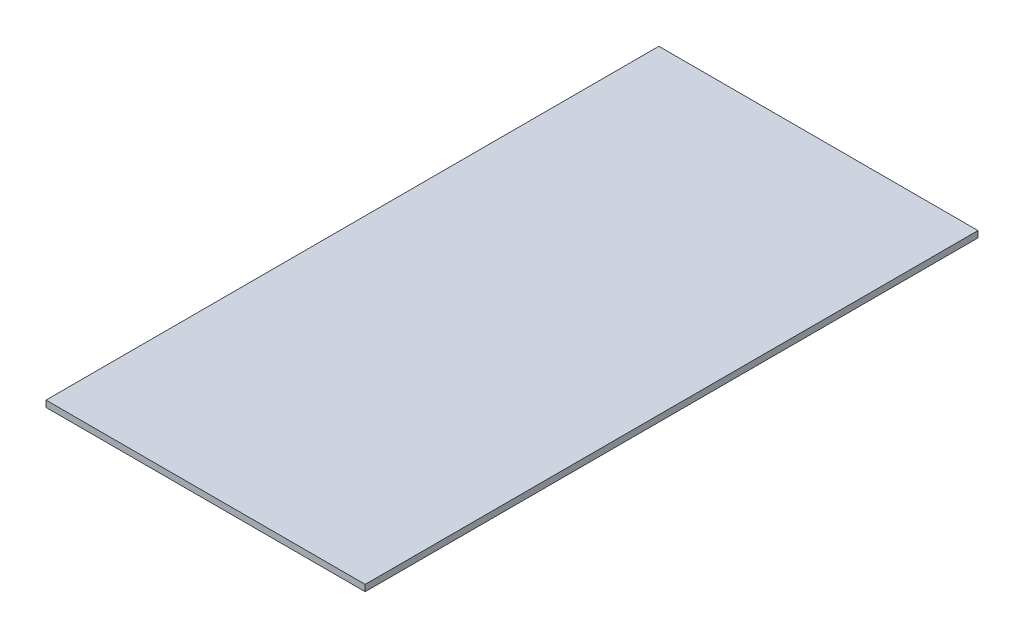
ISO-10303-21;
HEADER;
FILE_DESCRIPTION(('STEP AP214'),'2;1');
FILE_NAME('part.step','',(''),(''),'','','');
FILE_SCHEMA(('AUTOMOTIVE_DESIGN { 1 0 10303 214 1 1 1 1 }'));
ENDSEC;
DATA;
#1=APPLICATION_CONTEXT('core data for automotive mechanical design processes');
#2=APPLICATION_PROTOCOL_DEFINITION('international standard','automotive_design',2000,#1);
#3=PRODUCT_CONTEXT('',#1,'mechanical');
#4=PRODUCT('Part','Part','',(#3));
#5=PRODUCT_RELATED_PRODUCT_CATEGORY('part','',(#4));
#6=PRODUCT_DEFINITION_FORMATION('','',#4);
#7=PRODUCT_DEFINITION_CONTEXT('part definition',#1,'design');
#8=PRODUCT_DEFINITION('design','',#6,#7);
#9=PRODUCT_DEFINITION_SHAPE('','',#8);
#10=(LENGTH_UNIT() NAMED_UNIT(*) SI_UNIT(.MILLI.,.METRE.));
#11=(NAMED_UNIT(*) PLANE_ANGLE_UNIT() SI_UNIT($,.RADIAN.));
#12=(NAMED_UNIT(*) SI_UNIT($,.STERADIAN.) SOLID_ANGLE_UNIT());
#13=UNCERTAINTY_MEASURE_WITH_UNIT(LENGTH_MEASURE(1.E-05),#10,'distance_accuracy_value','');
#14=(GEOMETRIC_REPRESENTATION_CONTEXT(3) GLOBAL_UNCERTAINTY_ASSIGNED_CONTEXT((#13)) GLOBAL_UNIT_ASSIGNED_CONTEXT((#10,
#11,#12)) REPRESENTATION_CONTEXT('',''));
#15=CARTESIAN_POINT('',(0.,0.,0.));
#16=DIRECTION('',(0.,0.,1.));
#17=DIRECTION('',(1.,0.,0.));
#18=AXIS2_PLACEMENT_3D('',#15,#16,#17);
#19=CARTESIAN_POINT('',(317.5,6.35,609.6));
#20=DIRECTION('',(-1.,0.,0.));
#21=DIRECTION('',(0.,0.,1.));
#22=AXIS2_PLACEMENT_3D('',#19,#20,#21);
#23=PLANE('',#22);
#24=DIRECTION('',(0.,0.,-1.));
#25=VECTOR('',#24,1.);
#26=CARTESIAN_POINT('',(317.5,-6.35,609.6));
#27=LINE('',#26,#25);
#28=CARTESIAN_POINT('',(317.5,-6.35,609.6));
#29=VERTEX_POINT('',#28);
#30=CARTESIAN_POINT('',(317.5,-6.35,-609.6));
#31=VERTEX_POINT('',#30);
#32=EDGE_CURVE('E104',#29,#31,#27,.T.);
#33=ORIENTED_EDGE('',*,*,#32,.T.);
#34=DIRECTION('',(0.,-1.,0.));
#35=VECTOR('',#34,1.);
#36=CARTESIAN_POINT('',(317.5,6.35,-609.6));
#37=LINE('',#36,#35);
#38=CARTESIAN_POINT('',(317.5,6.35,-609.6));
#39=VERTEX_POINT('',#38);
#40=EDGE_CURVE('E11',#39,#31,#37,.T.);
#41=ORIENTED_EDGE('',*,*,#40,.F.);
#42=DIRECTION('',(0.,0.,-1.));
#43=VECTOR('',#42,1.);
#44=CARTESIAN_POINT('',(317.5,6.35,609.6));
#45=LINE('',#44,#43);
#46=CARTESIAN_POINT('',(317.5,6.35,609.6));
#47=VERTEX_POINT('',#46);
#48=EDGE_CURVE('E92',#47,#39,#45,.T.);
#49=ORIENTED_EDGE('',*,*,#48,.F.);
#50=DIRECTION('',(0.,-1.,0.));
#51=VECTOR('',#50,1.);
#52=CARTESIAN_POINT('',(317.5,6.35,609.6));
#53=LINE('',#52,#51);
#54=EDGE_CURVE('E100',#47,#29,#53,.T.);
#55=ORIENTED_EDGE('',*,*,#54,.T.);
#56=EDGE_LOOP('',(#33,#41,#49,#55));
#57=FACE_BOUND('',#56,.T.);
#58=ADVANCED_FACE('F41',(#57),#23,.F.);
#59=CARTESIAN_POINT('',(-317.5,6.35,-609.6));
#60=DIRECTION('',(0.,0.,1.));
#61=DIRECTION('',(1.,0.,0.));
#62=AXIS2_PLACEMENT_3D('',#59,#60,#61);
#63=PLANE('',#62);
#64=DIRECTION('',(-1.,0.,0.));
#65=VECTOR('',#64,1.);
#66=CARTESIAN_POINT('',(-317.5,-6.35,-609.6));
#67=LINE('',#66,#65);
#68=CARTESIAN_POINT('',(-317.5,-6.35,-609.6));
#69=VERTEX_POINT('',#68);
#70=EDGE_CURVE('E96',#31,#69,#67,.T.);
#71=ORIENTED_EDGE('',*,*,#70,.T.);
#72=DIRECTION('',(0.,-1.,0.));
#73=VECTOR('',#72,1.);
#74=CARTESIAN_POINT('',(-317.5,6.35,-609.6));
#75=LINE('',#74,#73);
#76=CARTESIAN_POINT('',(-317.5,6.35,-609.6));
#77=VERTEX_POINT('',#76);
#78=EDGE_CURVE('E49',#77,#69,#75,.T.);
#79=ORIENTED_EDGE('',*,*,#78,.F.);
#80=DIRECTION('',(-1.,0.,0.));
#81=VECTOR('',#80,1.);
#82=CARTESIAN_POINT('',(-317.5,6.35,-609.6));
#83=LINE('',#82,#81);
#84=EDGE_CURVE('E87',#39,#77,#83,.T.);
#85=ORIENTED_EDGE('',*,*,#84,.F.);
#86=ORIENTED_EDGE('',*,*,#40,.T.);
#87=EDGE_LOOP('',(#71,#79,#85,#86));
#88=FACE_BOUND('',#87,.T.);
#89=ADVANCED_FACE('F95',(#88),#63,.F.);
#90=CARTESIAN_POINT('',(-317.5,6.35,609.6));
#91=DIRECTION('',(1.,0.,0.));
#92=DIRECTION('',(0.,0.,-1.));
#93=AXIS2_PLACEMENT_3D('',#90,#91,#92);
#94=PLANE('',#93);
#95=DIRECTION('',(0.,0.,1.));
#96=VECTOR('',#95,1.);
#97=CARTESIAN_POINT('',(-317.5,-6.35,609.6));
#98=LINE('',#97,#96);
#99=CARTESIAN_POINT('',(-317.5,-6.35,609.6));
#100=VERTEX_POINT('',#99);
#101=EDGE_CURVE('E74',#69,#100,#98,.T.);
#102=ORIENTED_EDGE('',*,*,#101,.T.);
#103=DIRECTION('',(0.,-1.,0.));
#104=VECTOR('',#103,1.);
#105=CARTESIAN_POINT('',(-317.5,6.35,609.6));
#106=LINE('',#105,#104);
#107=CARTESIAN_POINT('',(-317.5,6.35,609.6));
#108=VERTEX_POINT('',#107);
#109=EDGE_CURVE('E97',#108,#100,#106,.T.);
#110=ORIENTED_EDGE('',*,*,#109,.F.);
#111=DIRECTION('',(0.,0.,1.));
#112=VECTOR('',#111,1.);
#113=CARTESIAN_POINT('',(-317.5,6.35,609.6));
#114=LINE('',#113,#112);
#115=EDGE_CURVE('E90',#77,#108,#114,.T.);
#116=ORIENTED_EDGE('',*,*,#115,.F.);
#117=ORIENTED_EDGE('',*,*,#78,.T.);
#118=EDGE_LOOP('',(#102,#110,#116,#117));
#119=FACE_BOUND('',#118,.T.);
#120=ADVANCED_FACE('F98',(#119),#94,.F.);
#121=CARTESIAN_POINT('',(-317.5,6.35,609.6));
#122=DIRECTION('',(0.,0.,-1.));
#123=DIRECTION('',(-1.,0.,0.));
#124=AXIS2_PLACEMENT_3D('',#121,#122,#123);
#125=PLANE('',#124);
#126=DIRECTION('',(1.,0.,0.));
#127=VECTOR('',#126,1.);
#128=CARTESIAN_POINT('',(-317.5,-6.35,609.6));
#129=LINE('',#128,#127);
#130=EDGE_CURVE('E80',#100,#29,#129,.T.);
#131=ORIENTED_EDGE('',*,*,#130,.T.);
#132=ORIENTED_EDGE('',*,*,#54,.F.);
#133=DIRECTION('',(1.,0.,0.));
#134=VECTOR('',#133,1.);
#135=CARTESIAN_POINT('',(-317.5,6.35,609.6));
#136=LINE('',#135,#134);
#137=EDGE_CURVE('E57',#108,#47,#136,.T.);
#138=ORIENTED_EDGE('',*,*,#137,.F.);
#139=ORIENTED_EDGE('',*,*,#109,.T.);
#140=EDGE_LOOP('',(#131,#132,#138,#139));
#141=FACE_BOUND('',#140,.T.);
#142=ADVANCED_FACE('F111',(#141),#125,.F.);
#143=CARTESIAN_POINT('',(0.,6.35,0.));
#144=DIRECTION('',(0.,-1.,0.));
#145=DIRECTION('',(0.,0.,-1.));
#146=AXIS2_PLACEMENT_3D('',#143,#144,#145);
#147=PLANE('',#146);
#148=ORIENTED_EDGE('',*,*,#48,.T.);
#149=ORIENTED_EDGE('',*,*,#84,.T.);
#150=ORIENTED_EDGE('',*,*,#115,.T.);
#151=ORIENTED_EDGE('',*,*,#137,.T.);
#152=EDGE_LOOP('',(#148,#149,#150,#151));
#153=FACE_BOUND('',#152,.T.);
#154=ADVANCED_FACE('F88',(#153),#147,.F.);
#155=CARTESIAN_POINT('',(0.,-6.35,0.));
#156=DIRECTION('',(0.,-1.,0.));
#157=DIRECTION('',(0.,0.,-1.));
#158=AXIS2_PLACEMENT_3D('',#155,#156,#157);
#159=PLANE('',#158);
#160=ORIENTED_EDGE('',*,*,#32,.F.);
#161=ORIENTED_EDGE('',*,*,#130,.F.);
#162=ORIENTED_EDGE('',*,*,#101,.F.);
#163=ORIENTED_EDGE('',*,*,#70,.F.);
#164=EDGE_LOOP('',(#160,#161,#162,#163));
#165=FACE_BOUND('',#164,.T.);
#166=ADVANCED_FACE('F114',(#165),#159,.T.);
#167=CLOSED_SHELL('',(#58,#89,#120,#142,#154,#166));
#168=MANIFOLD_SOLID_BREP('B2',#167);
#169=ADVANCED_BREP_SHAPE_REPRESENTATION('',(#18,#168),#14);
#170=SHAPE_DEFINITION_REPRESENTATION(#9,#169);
ENDSEC;
END-ISO-10303-21;
